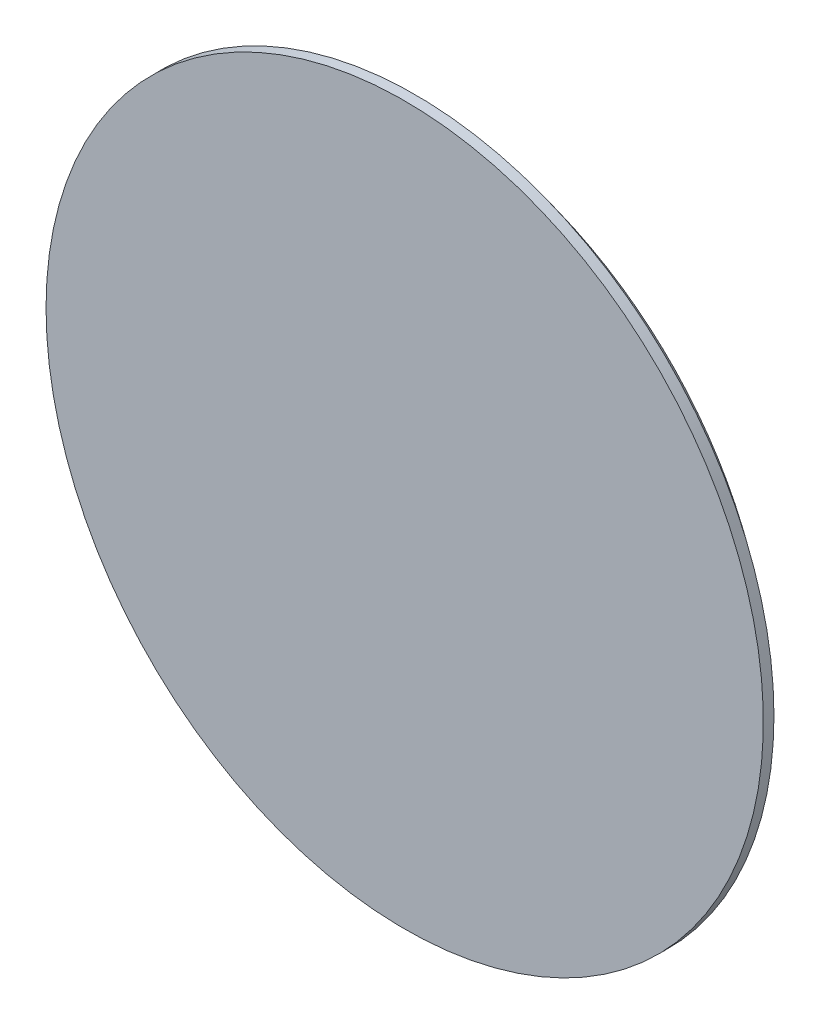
ISO-10303-21;
HEADER;
FILE_DESCRIPTION(('STEP AP214'),'2;1');
FILE_NAME('part.step','',(''),(''),'','','');
FILE_SCHEMA(('AUTOMOTIVE_DESIGN { 1 0 10303 214 1 1 1 1 }'));
ENDSEC;
DATA;
#1=APPLICATION_CONTEXT('core data for automotive mechanical design processes');
#2=APPLICATION_PROTOCOL_DEFINITION('international standard','automotive_design',2000,#1);
#3=PRODUCT_CONTEXT('',#1,'mechanical');
#4=PRODUCT('Part','Part','',(#3));
#5=PRODUCT_RELATED_PRODUCT_CATEGORY('part','',(#4));
#6=PRODUCT_DEFINITION_FORMATION('','',#4);
#7=PRODUCT_DEFINITION_CONTEXT('part definition',#1,'design');
#8=PRODUCT_DEFINITION('design','',#6,#7);
#9=PRODUCT_DEFINITION_SHAPE('','',#8);
#10=(LENGTH_UNIT() NAMED_UNIT(*) SI_UNIT(.MILLI.,.METRE.));
#11=(NAMED_UNIT(*) PLANE_ANGLE_UNIT() SI_UNIT($,.RADIAN.));
#12=(NAMED_UNIT(*) SI_UNIT($,.STERADIAN.) SOLID_ANGLE_UNIT());
#13=UNCERTAINTY_MEASURE_WITH_UNIT(LENGTH_MEASURE(1.E-05),#10,'distance_accuracy_value','');
#14=(GEOMETRIC_REPRESENTATION_CONTEXT(3) GLOBAL_UNCERTAINTY_ASSIGNED_CONTEXT((#13)) GLOBAL_UNIT_ASSIGNED_CONTEXT((#10,
#11,#12)) REPRESENTATION_CONTEXT('',''));
#15=CARTESIAN_POINT('',(0.,0.,0.));
#16=DIRECTION('',(0.,0.,1.));
#17=DIRECTION('',(1.,0.,0.));
#18=AXIS2_PLACEMENT_3D('',#15,#16,#17);
#19=CARTESIAN_POINT('',(0.,0.,244.737777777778));
#20=DIRECTION('',(0.,0.,-1.));
#21=DIRECTION('',(1.,0.,0.));
#22=AXIS2_PLACEMENT_3D('',#19,#20,#21);
#23=SPHERICAL_SURFACE('',#22,322.737777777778);
#24=CARTESIAN_POINT('',(0.,0.,-6.00000000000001));
#25=DIRECTION('',(0.,0.,-1.));
#26=DIRECTION('',(-1.,0.,0.));
#27=AXIS2_PLACEMENT_3D('',#24,#25,#26);
#28=CIRCLE('',#27,203.2);
#29=CARTESIAN_POINT('',(-203.2,0.,-6.00000000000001));
#30=VERTEX_POINT('',#29);
#31=EDGE_CURVE('E10',#30,#30,#28,.T.);
#32=ORIENTED_EDGE('',*,*,#31,.T.);
#33=EDGE_LOOP('',(#32));
#34=FACE_BOUND('',#33,.T.);
#35=ADVANCED_FACE('F31',(#34),#23,.T.);
#36=CARTESIAN_POINT('',(0.,0.,-88.99));
#37=DIRECTION('',(0.,0.,-1.));
#38=DIRECTION('',(-1.,0.,0.));
#39=AXIS2_PLACEMENT_3D('',#36,#37,#38);
#40=CYLINDRICAL_SURFACE('',#39,203.2);
#41=ORIENTED_EDGE('',*,*,#31,.F.);
#42=EDGE_LOOP('',(#41));
#43=FACE_BOUND('',#42,.T.);
#44=CARTESIAN_POINT('',(0.,0.,0.));
#45=DIRECTION('',(0.,0.,-1.));
#46=DIRECTION('',(-1.,0.,0.));
#47=AXIS2_PLACEMENT_3D('',#44,#45,#46);
#48=CIRCLE('',#47,203.2);
#49=CARTESIAN_POINT('',(-203.2,0.,0.));
#50=VERTEX_POINT('',#49);
#51=EDGE_CURVE('E37',#50,#50,#48,.T.);
#52=ORIENTED_EDGE('',*,*,#51,.T.);
#53=EDGE_LOOP('',(#52));
#54=FACE_BOUND('',#53,.T.);
#55=ADVANCED_FACE('F43',(#43,#54),#40,.T.);
#56=CARTESIAN_POINT('',(203.2,0.,0.));
#57=DIRECTION('',(0.,0.,-1.));
#58=DIRECTION('',(-1.,0.,0.));
#59=AXIS2_PLACEMENT_3D('',#56,#57,#58);
#60=PLANE('',#59);
#61=ORIENTED_EDGE('',*,*,#51,.F.);
#62=EDGE_LOOP('',(#61));
#63=FACE_BOUND('',#62,.T.);
#64=ADVANCED_FACE('F45',(#63),#60,.F.);
#65=CLOSED_SHELL('',(#35,#55,#64));
#66=MANIFOLD_SOLID_BREP('B2',#65);
#67=ADVANCED_BREP_SHAPE_REPRESENTATION('',(#18,#66),#14);
#68=SHAPE_DEFINITION_REPRESENTATION(#9,#67);
ENDSEC;
END-ISO-10303-21;
